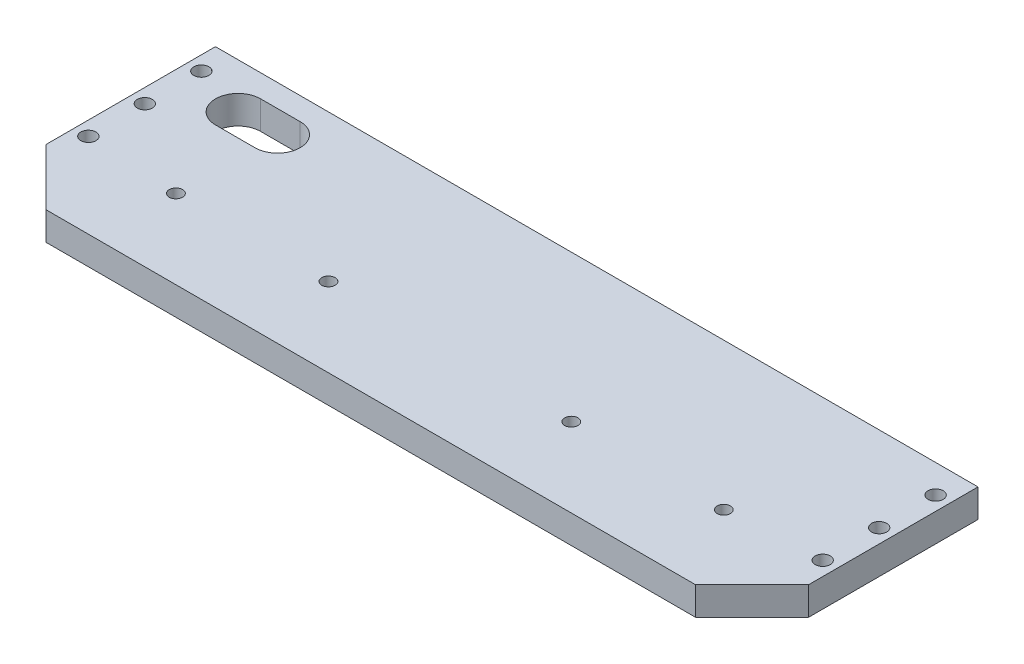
from build123d import *

# Parameters (mm, degrees)
SKETCH1_W           = 171.45
SKETCH1_H           = 6.35
BOSS_EXTRUDE1_DEPTH = 50.8
CHAMFER1_SIZE       = 12.7
SKETCH3_R           = 1.5
CUT_EXTRUDE2_DEPTH  = 211.30165291
SKETCH4_R           = 1.7
CUT_EXTRUDE3_DEPTH  = 211.30165291
CUT_EXTRUDE4_DEPTH  = 211.30165291


with BuildPart() as part:
    # Sketch1 → Boss-Extrude1 (new body)
    with BuildSketch(Plane.XY):
        with Locations((-118.250054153, 276.225)):
            Rectangle(SKETCH1_W, SKETCH1_H)
    extrude(amount=BOSS_EXTRUDE1_DEPTH)

    # Chamfer1
    chamfer1_edges = [part.edges().sort_by_distance(p)[0] for p in [
        (-203.975054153, 276.225, 50.8),
        (-32.525054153, 276.225, 50.8),
    ]]
    chamfer(chamfer1_edges, length=CHAMFER1_SIZE)

    # Sketch3 → Cut-Extrude2 (cut, through all)
    with BuildSketch(Plane(origin=(0, 279.4, 0), x_dir=(1, 0, 0), z_dir=(0, 1, 0))):
        with Locations(Location((-90.945054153, -33.02, 0), (0, 0, 270))):
            Circle(SKETCH3_R)
        with Locations(Location((-56.655054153, -33.02, 0), (0, 0, 270))):
            Circle(SKETCH3_R)
        with Locations(Location((-145.555054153, -33.02, 0), (0, 0, 270))):
            Circle(SKETCH3_R)
        with Locations(Location((-179.845054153, -33.02, 0), (0, 0, 270))):
            Circle(SKETCH3_R)
    extrude(amount=-CUT_EXTRUDE2_DEPTH, mode=Mode.SUBTRACT)

    # Sketch4 → Cut-Extrude3 (cut, through all)
    with BuildSketch(Plane(origin=(0, 279.4, 0), x_dir=(1, 0, 0), z_dir=(0, 1, 0))):
        with Locations(Location((-200.800054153, -6.35, 0), (0, 0, 270))):
            Circle(SKETCH4_R)
        with Locations(Location((-200.800054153, -19.05, 0), (0, 0, 270))):
            Circle(SKETCH4_R)
        with Locations(Location((-200.800054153, -31.75, 0), (0, 0, 270))):
            Circle(SKETCH4_R)
        with Locations(Location((-35.700054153, -31.75, 0), (0, 0, 270))):
            Circle(SKETCH4_R)
        with Locations(Location((-35.700054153, -19.05, 0), (0, 0, 270))):
            Circle(SKETCH4_R)
        with Locations(Location((-35.700054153, -6.35, 0), (0, 0, 270))):
            Circle(SKETCH4_R)
    extrude(amount=-CUT_EXTRUDE3_DEPTH, mode=Mode.SUBTRACT)

    # Sketch5 → Cut-Extrude4 (cut, through all)
    with BuildSketch(Plane(origin=(0, 273.05, 0), x_dir=(-1, 0, 0), z_dir=(0, -1, 0))):
        with BuildLine():
            Line((179.845054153, -5.08), (188.735054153, -5.08))
            ThreePointArc((188.735054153, -5.08), (193.815054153, -10.16), (188.735054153, -15.24))
            Line((188.735054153, -15.24), (179.845054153, -15.24))
            ThreePointArc((179.845054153, -15.24), (174.765054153, -10.16), (179.845054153, -5.08))
        make_face()
    extrude(amount=-CUT_EXTRUDE4_DEPTH, mode=Mode.SUBTRACT)


solid = part.part
